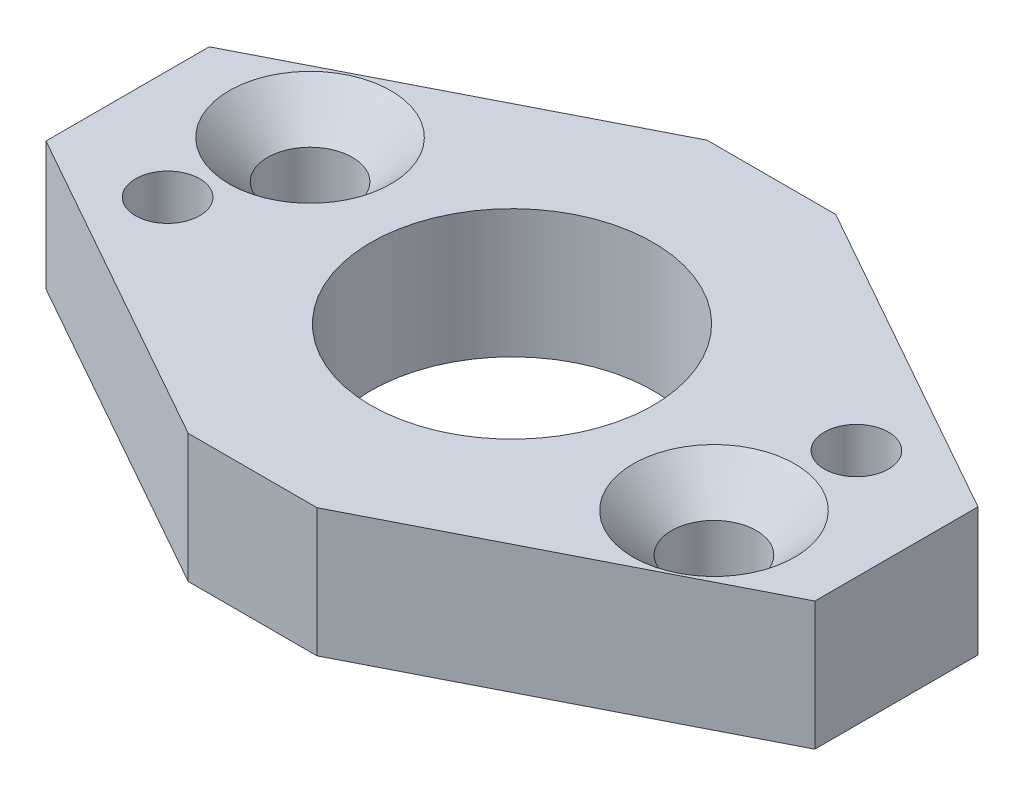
ISO-10303-21;
HEADER;
FILE_DESCRIPTION(('STEP AP214'),'2;1');
FILE_NAME('part.step','',(''),(''),'','','');
FILE_SCHEMA(('AUTOMOTIVE_DESIGN { 1 0 10303 214 1 1 1 1 }'));
ENDSEC;
DATA;
#1=APPLICATION_CONTEXT('core data for automotive mechanical design processes');
#2=APPLICATION_PROTOCOL_DEFINITION('international standard','automotive_design',2000,#1);
#3=PRODUCT_CONTEXT('',#1,'mechanical');
#4=PRODUCT('Part','Part','',(#3));
#5=PRODUCT_RELATED_PRODUCT_CATEGORY('part','',(#4));
#6=PRODUCT_DEFINITION_FORMATION('','',#4);
#7=PRODUCT_DEFINITION_CONTEXT('part definition',#1,'design');
#8=PRODUCT_DEFINITION('design','',#6,#7);
#9=PRODUCT_DEFINITION_SHAPE('','',#8);
#10=(LENGTH_UNIT() NAMED_UNIT(*) SI_UNIT(.MILLI.,.METRE.));
#11=(NAMED_UNIT(*) PLANE_ANGLE_UNIT() SI_UNIT($,.RADIAN.));
#12=(NAMED_UNIT(*) SI_UNIT($,.STERADIAN.) SOLID_ANGLE_UNIT());
#13=UNCERTAINTY_MEASURE_WITH_UNIT(LENGTH_MEASURE(1.E-05),#10,'distance_accuracy_value','');
#14=(GEOMETRIC_REPRESENTATION_CONTEXT(3) GLOBAL_UNCERTAINTY_ASSIGNED_CONTEXT((#13)) GLOBAL_UNIT_ASSIGNED_CONTEXT((#10,
#11,#12)) REPRESENTATION_CONTEXT('',''));
#15=CARTESIAN_POINT('',(0.,0.,0.));
#16=DIRECTION('',(0.,0.,1.));
#17=DIRECTION('',(1.,0.,0.));
#18=AXIS2_PLACEMENT_3D('',#15,#16,#17);
#19=CARTESIAN_POINT('',(-30.5,10.,-20.));
#20=DIRECTION('',(1.,0.,0.));
#21=DIRECTION('',(0.,0.,-1.));
#22=AXIS2_PLACEMENT_3D('',#19,#20,#21);
#23=PLANE('',#22);
#24=DIRECTION('',(0.,0.,1.));
#25=VECTOR('',#24,1.);
#26=CARTESIAN_POINT('',(-30.5,0.,-20.));
#27=LINE('',#26,#25);
#28=CARTESIAN_POINT('',(-30.5,0.,-6.90354936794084));
#29=VERTEX_POINT('',#28);
#30=CARTESIAN_POINT('',(-30.5,0.,5.81325296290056));
#31=VERTEX_POINT('',#30);
#32=EDGE_CURVE('E127',#29,#31,#27,.T.);
#33=ORIENTED_EDGE('',*,*,#32,.T.);
#34=DIRECTION('',(0.,1.,0.));
#35=VECTOR('',#34,1.);
#36=CARTESIAN_POINT('',(-30.5,0.,5.81325296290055));
#37=LINE('',#36,#35);
#38=CARTESIAN_POINT('',(-30.5,10.,5.81325296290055));
#39=VERTEX_POINT('',#38);
#40=EDGE_CURVE('E63',#31,#39,#37,.T.);
#41=ORIENTED_EDGE('',*,*,#40,.T.);
#42=DIRECTION('',(0.,0.,1.));
#43=VECTOR('',#42,1.);
#44=CARTESIAN_POINT('',(-30.5,10.,-20.));
#45=LINE('',#44,#43);
#46=CARTESIAN_POINT('',(-30.5,10.,-6.90354936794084));
#47=VERTEX_POINT('',#46);
#48=EDGE_CURVE('E126',#47,#39,#45,.T.);
#49=ORIENTED_EDGE('',*,*,#48,.F.);
#50=DIRECTION('',(0.,1.,0.));
#51=VECTOR('',#50,1.);
#52=CARTESIAN_POINT('',(-30.5,0.,-6.90354936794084));
#53=LINE('',#52,#51);
#54=EDGE_CURVE('E184',#29,#47,#53,.T.);
#55=ORIENTED_EDGE('',*,*,#54,.F.);
#56=EDGE_LOOP('',(#33,#41,#49,#55));
#57=FACE_BOUND('',#56,.T.);
#58=ADVANCED_FACE('F39',(#57),#23,.F.);
#59=CARTESIAN_POINT('',(-30.5,10.,20.));
#60=DIRECTION('',(0.,0.,-1.));
#61=DIRECTION('',(-1.,0.,0.));
#62=AXIS2_PLACEMENT_3D('',#59,#60,#61);
#63=PLANE('',#62);
#64=DIRECTION('',(1.,0.,0.));
#65=VECTOR('',#64,1.);
#66=CARTESIAN_POINT('',(-30.5,0.,20.));
#67=LINE('',#66,#65);
#68=CARTESIAN_POINT('',(-5.23017488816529,0.,20.));
#69=VERTEX_POINT('',#68);
#70=CARTESIAN_POINT('',(4.80253523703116,0.,20.));
#71=VERTEX_POINT('',#70);
#72=EDGE_CURVE('E124',#69,#71,#67,.T.);
#73=ORIENTED_EDGE('',*,*,#72,.T.);
#74=DIRECTION('',(0.,1.,0.));
#75=VECTOR('',#74,1.);
#76=CARTESIAN_POINT('',(4.80253523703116,0.,20.));
#77=LINE('',#76,#75);
#78=CARTESIAN_POINT('',(4.80253523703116,10.,20.));
#79=VERTEX_POINT('',#78);
#80=EDGE_CURVE('E55',#71,#79,#77,.T.);
#81=ORIENTED_EDGE('',*,*,#80,.T.);
#82=DIRECTION('',(1.,0.,0.));
#83=VECTOR('',#82,1.);
#84=CARTESIAN_POINT('',(-30.5,10.,20.));
#85=LINE('',#84,#83);
#86=CARTESIAN_POINT('',(-5.23017488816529,10.,20.));
#87=VERTEX_POINT('',#86);
#88=EDGE_CURVE('E134',#87,#79,#85,.T.);
#89=ORIENTED_EDGE('',*,*,#88,.F.);
#90=DIRECTION('',(0.,1.,0.));
#91=VECTOR('',#90,1.);
#92=CARTESIAN_POINT('',(-5.23017488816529,0.,20.));
#93=LINE('',#92,#91);
#94=EDGE_CURVE('E192',#69,#87,#93,.T.);
#95=ORIENTED_EDGE('',*,*,#94,.F.);
#96=EDGE_LOOP('',(#73,#81,#89,#95));
#97=FACE_BOUND('',#96,.T.);
#98=ADVANCED_FACE('F203',(#97),#63,.F.);
#99=CARTESIAN_POINT('',(30.5,10.,-20.));
#100=DIRECTION('',(-1.,0.,0.));
#101=DIRECTION('',(0.,0.,1.));
#102=AXIS2_PLACEMENT_3D('',#99,#100,#101);
#103=PLANE('',#102);
#104=DIRECTION('',(0.,0.,-1.));
#105=VECTOR('',#104,1.);
#106=CARTESIAN_POINT('',(30.5,10.,-20.));
#107=LINE('',#106,#105);
#108=CARTESIAN_POINT('',(30.5,10.,6.90354936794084));
#109=VERTEX_POINT('',#108);
#110=CARTESIAN_POINT('',(30.5,10.,-5.81325296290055));
#111=VERTEX_POINT('',#110);
#112=EDGE_CURVE('E47',#109,#111,#107,.T.);
#113=ORIENTED_EDGE('',*,*,#112,.F.);
#114=DIRECTION('',(0.,1.,0.));
#115=VECTOR('',#114,1.);
#116=CARTESIAN_POINT('',(30.5,0.,6.90354936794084));
#117=LINE('',#116,#115);
#118=CARTESIAN_POINT('',(30.5,0.,6.90354936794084));
#119=VERTEX_POINT('',#118);
#120=EDGE_CURVE('E105',#119,#109,#117,.T.);
#121=ORIENTED_EDGE('',*,*,#120,.F.);
#122=DIRECTION('',(0.,0.,-1.));
#123=VECTOR('',#122,1.);
#124=CARTESIAN_POINT('',(30.5,0.,-20.));
#125=LINE('',#124,#123);
#126=CARTESIAN_POINT('',(30.5,0.,-5.81325296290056));
#127=VERTEX_POINT('',#126);
#128=EDGE_CURVE('E117',#119,#127,#125,.T.);
#129=ORIENTED_EDGE('',*,*,#128,.T.);
#130=DIRECTION('',(0.,1.,0.));
#131=VECTOR('',#130,1.);
#132=CARTESIAN_POINT('',(30.5,0.,-5.81325296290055));
#133=LINE('',#132,#131);
#134=EDGE_CURVE('E177',#127,#111,#133,.T.);
#135=ORIENTED_EDGE('',*,*,#134,.T.);
#136=EDGE_LOOP('',(#113,#121,#129,#135));
#137=FACE_BOUND('',#136,.T.);
#138=ADVANCED_FACE('F115',(#137),#103,.F.);
#139=CARTESIAN_POINT('',(-30.5,10.,-20.));
#140=DIRECTION('',(0.,0.,1.));
#141=DIRECTION('',(1.,0.,0.));
#142=AXIS2_PLACEMENT_3D('',#139,#140,#141);
#143=PLANE('',#142);
#144=DIRECTION('',(-1.,0.,0.));
#145=VECTOR('',#144,1.);
#146=CARTESIAN_POINT('',(-30.5,0.,-20.));
#147=LINE('',#146,#145);
#148=CARTESIAN_POINT('',(5.23017488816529,0.,-20.));
#149=VERTEX_POINT('',#148);
#150=CARTESIAN_POINT('',(-4.80253523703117,0.,-20.));
#151=VERTEX_POINT('',#150);
#152=EDGE_CURVE('E42',#149,#151,#147,.T.);
#153=ORIENTED_EDGE('',*,*,#152,.T.);
#154=DIRECTION('',(0.,1.,0.));
#155=VECTOR('',#154,1.);
#156=CARTESIAN_POINT('',(-4.80253523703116,0.,-20.));
#157=LINE('',#156,#155);
#158=CARTESIAN_POINT('',(-4.80253523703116,10.,-20.));
#159=VERTEX_POINT('',#158);
#160=EDGE_CURVE('E174',#151,#159,#157,.T.);
#161=ORIENTED_EDGE('',*,*,#160,.T.);
#162=DIRECTION('',(-1.,0.,0.));
#163=VECTOR('',#162,1.);
#164=CARTESIAN_POINT('',(-30.5,10.,-20.));
#165=LINE('',#164,#163);
#166=CARTESIAN_POINT('',(5.23017488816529,10.,-20.));
#167=VERTEX_POINT('',#166);
#168=EDGE_CURVE('E11',#167,#159,#165,.T.);
#169=ORIENTED_EDGE('',*,*,#168,.F.);
#170=DIRECTION('',(0.,1.,0.));
#171=VECTOR('',#170,1.);
#172=CARTESIAN_POINT('',(5.23017488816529,0.,-20.));
#173=LINE('',#172,#171);
#174=EDGE_CURVE('E175',#149,#167,#173,.T.);
#175=ORIENTED_EDGE('',*,*,#174,.F.);
#176=EDGE_LOOP('',(#153,#161,#169,#175));
#177=FACE_BOUND('',#176,.T.);
#178=ADVANCED_FACE('F217',(#177),#143,.F.);
#179=CARTESIAN_POINT('',(0.,10.,0.));
#180=DIRECTION('',(0.,1.,0.));
#181=DIRECTION('',(0.,0.,1.));
#182=AXIS2_PLACEMENT_3D('',#179,#180,#181);
#183=PLANE('',#182);
#184=DIRECTION('',(-0.890965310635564,0.,0.454071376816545));
#185=VECTOR('',#184,1.);
#186=CARTESIAN_POINT('',(30.5,10.,6.90354936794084));
#187=LINE('',#186,#185);
#188=EDGE_CURVE('E111',#109,#79,#187,.T.);
#189=ORIENTED_EDGE('',*,*,#188,.F.);
#190=ORIENTED_EDGE('',*,*,#112,.T.);
#191=DIRECTION('',(0.871981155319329,0.,0.489539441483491));
#192=VECTOR('',#191,1.);
#193=CARTESIAN_POINT('',(30.5,10.,-5.81325296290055));
#194=LINE('',#193,#192);
#195=EDGE_CURVE('E180',#167,#111,#194,.T.);
#196=ORIENTED_EDGE('',*,*,#195,.F.);
#197=ORIENTED_EDGE('',*,*,#168,.T.);
#198=DIRECTION('',(0.890965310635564,0.,-0.454071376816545));
#199=VECTOR('',#198,1.);
#200=CARTESIAN_POINT('',(-30.5,10.,-6.90354936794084));
#201=LINE('',#200,#199);
#202=EDGE_CURVE('E179',#47,#159,#201,.T.);
#203=ORIENTED_EDGE('',*,*,#202,.F.);
#204=ORIENTED_EDGE('',*,*,#48,.T.);
#205=DIRECTION('',(-0.871981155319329,0.,-0.489539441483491));
#206=VECTOR('',#205,1.);
#207=CARTESIAN_POINT('',(-30.5,10.,5.81325296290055));
#208=LINE('',#207,#206);
#209=EDGE_CURVE('E196',#87,#39,#208,.T.);
#210=ORIENTED_EDGE('',*,*,#209,.F.);
#211=ORIENTED_EDGE('',*,*,#88,.T.);
#212=EDGE_LOOP('',(#189,#190,#196,#197,#203,#204,#210,#211));
#213=FACE_BOUND('',#212,.T.);
#214=CARTESIAN_POINT('',(20.4617713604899,10.,4.72397214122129));
#215=DIRECTION('',(0.,1.,0.));
#216=DIRECTION('',(0.,0.,1.));
#217=AXIS2_PLACEMENT_3D('',#214,#215,#216);
#218=CIRCLE('',#217,6.3);
#219=CARTESIAN_POINT('',(20.4617713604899,10.,11.0239721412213));
#220=VERTEX_POINT('',#219);
#221=EDGE_CURVE('E171',#220,#220,#218,.T.);
#222=ORIENTED_EDGE('',*,*,#221,.F.);
#223=EDGE_LOOP('',(#222));
#224=FACE_BOUND('',#223,.T.);
#225=CARTESIAN_POINT('',(-20.4617713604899,10.,-4.7239721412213));
#226=DIRECTION('',(0.,1.,0.));
#227=DIRECTION('',(0.,0.,1.));
#228=AXIS2_PLACEMENT_3D('',#225,#226,#227);
#229=CIRCLE('',#228,6.3);
#230=CARTESIAN_POINT('',(-20.4617713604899,10.,1.5760278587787));
#231=VERTEX_POINT('',#230);
#232=EDGE_CURVE('E162',#231,#231,#229,.T.);
#233=ORIENTED_EDGE('',*,*,#232,.F.);
#234=EDGE_LOOP('',(#233));
#235=FACE_BOUND('',#234,.T.);
#236=CARTESIAN_POINT('',(-21.9666601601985,10.,4.86989131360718));
#237=DIRECTION('',(0.,1.,0.));
#238=DIRECTION('',(0.,0.,1.));
#239=AXIS2_PLACEMENT_3D('',#236,#237,#238);
#240=CIRCLE('',#239,2.49999999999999);
#241=CARTESIAN_POINT('',(-21.9666601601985,10.,7.36989131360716));
#242=VERTEX_POINT('',#241);
#243=EDGE_CURVE('E153',#242,#242,#240,.T.);
#244=ORIENTED_EDGE('',*,*,#243,.F.);
#245=EDGE_LOOP('',(#244));
#246=FACE_BOUND('',#245,.T.);
#247=CARTESIAN_POINT('',(21.9666601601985,10.,-4.86989131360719));
#248=DIRECTION('',(0.,1.,0.));
#249=DIRECTION('',(0.,0.,1.));
#250=AXIS2_PLACEMENT_3D('',#247,#248,#249);
#251=CIRCLE('',#250,2.49999999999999);
#252=CARTESIAN_POINT('',(21.9666601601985,10.,-2.3698913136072));
#253=VERTEX_POINT('',#252);
#254=EDGE_CURVE('E147',#253,#253,#251,.T.);
#255=ORIENTED_EDGE('',*,*,#254,.F.);
#256=EDGE_LOOP('',(#255));
#257=FACE_BOUND('',#256,.T.);
#258=CARTESIAN_POINT('',(0.,10.,0.));
#259=DIRECTION('',(0.,1.,0.));
#260=DIRECTION('',(0.,0.,1.));
#261=AXIS2_PLACEMENT_3D('',#258,#259,#260);
#262=CIRCLE('',#261,11.);
#263=CARTESIAN_POINT('',(0.,10.,11.));
#264=VERTEX_POINT('',#263);
#265=EDGE_CURVE('E139',#264,#264,#262,.T.);
#266=ORIENTED_EDGE('',*,*,#265,.F.);
#267=EDGE_LOOP('',(#266));
#268=FACE_BOUND('',#267,.T.);
#269=ADVANCED_FACE('F206',(#213,#224,#235,#246,#257,#268),#183,.T.);
#270=CARTESIAN_POINT('',(0.,0.,0.));
#271=DIRECTION('',(0.,1.,0.));
#272=DIRECTION('',(0.,0.,1.));
#273=AXIS2_PLACEMENT_3D('',#270,#271,#272);
#274=PLANE('',#273);
#275=CARTESIAN_POINT('',(20.4617713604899,0.,4.72397214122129));
#276=DIRECTION('',(0.,1.,0.));
#277=DIRECTION('',(0.,0.,1.));
#278=AXIS2_PLACEMENT_3D('',#275,#276,#277);
#279=CIRCLE('',#278,3.3);
#280=CARTESIAN_POINT('',(20.4617713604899,0.,8.02397214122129));
#281=VERTEX_POINT('',#280);
#282=EDGE_CURVE('E165',#281,#281,#279,.T.);
#283=ORIENTED_EDGE('',*,*,#282,.T.);
#284=EDGE_LOOP('',(#283));
#285=FACE_BOUND('',#284,.T.);
#286=CARTESIAN_POINT('',(-20.4617713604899,0.,-4.7239721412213));
#287=DIRECTION('',(0.,1.,0.));
#288=DIRECTION('',(0.,0.,1.));
#289=AXIS2_PLACEMENT_3D('',#286,#287,#288);
#290=CIRCLE('',#289,3.3);
#291=CARTESIAN_POINT('',(-20.4617713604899,0.,-1.4239721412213));
#292=VERTEX_POINT('',#291);
#293=EDGE_CURVE('E156',#292,#292,#290,.T.);
#294=ORIENTED_EDGE('',*,*,#293,.T.);
#295=EDGE_LOOP('',(#294));
#296=FACE_BOUND('',#295,.T.);
#297=CARTESIAN_POINT('',(-21.9666601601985,0.,4.86989131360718));
#298=DIRECTION('',(0.,1.,0.));
#299=DIRECTION('',(0.,0.,1.));
#300=AXIS2_PLACEMENT_3D('',#297,#298,#299);
#301=CIRCLE('',#300,2.49999999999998);
#302=CARTESIAN_POINT('',(-21.9666601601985,0.,7.36989131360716));
#303=VERTEX_POINT('',#302);
#304=EDGE_CURVE('E150',#303,#303,#301,.T.);
#305=ORIENTED_EDGE('',*,*,#304,.T.);
#306=EDGE_LOOP('',(#305));
#307=FACE_BOUND('',#306,.T.);
#308=CARTESIAN_POINT('',(21.9666601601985,0.,-4.86989131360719));
#309=DIRECTION('',(0.,1.,0.));
#310=DIRECTION('',(0.,0.,1.));
#311=AXIS2_PLACEMENT_3D('',#308,#309,#310);
#312=CIRCLE('',#311,2.49999999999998);
#313=CARTESIAN_POINT('',(21.9666601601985,0.,-2.36989131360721));
#314=VERTEX_POINT('',#313);
#315=EDGE_CURVE('E142',#314,#314,#312,.T.);
#316=ORIENTED_EDGE('',*,*,#315,.T.);
#317=EDGE_LOOP('',(#316));
#318=FACE_BOUND('',#317,.T.);
#319=CARTESIAN_POINT('',(0.,0.,0.));
#320=DIRECTION('',(0.,1.,0.));
#321=DIRECTION('',(0.,0.,1.));
#322=AXIS2_PLACEMENT_3D('',#319,#320,#321);
#323=CIRCLE('',#322,11.);
#324=CARTESIAN_POINT('',(0.,0.,11.));
#325=VERTEX_POINT('',#324);
#326=EDGE_CURVE('E131',#325,#325,#323,.T.);
#327=ORIENTED_EDGE('',*,*,#326,.T.);
#328=EDGE_LOOP('',(#327));
#329=FACE_BOUND('',#328,.T.);
#330=ORIENTED_EDGE('',*,*,#128,.F.);
#331=DIRECTION('',(-0.890965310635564,0.,0.454071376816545));
#332=VECTOR('',#331,1.);
#333=CARTESIAN_POINT('',(30.5,0.,6.90354936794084));
#334=LINE('',#333,#332);
#335=EDGE_CURVE('E102',#119,#71,#334,.T.);
#336=ORIENTED_EDGE('',*,*,#335,.T.);
#337=ORIENTED_EDGE('',*,*,#72,.F.);
#338=DIRECTION('',(-0.871981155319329,0.,-0.489539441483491));
#339=VECTOR('',#338,1.);
#340=CARTESIAN_POINT('',(-30.5,0.,5.81325296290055));
#341=LINE('',#340,#339);
#342=EDGE_CURVE('E194',#69,#31,#341,.T.);
#343=ORIENTED_EDGE('',*,*,#342,.T.);
#344=ORIENTED_EDGE('',*,*,#32,.F.);
#345=DIRECTION('',(0.890965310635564,0.,-0.454071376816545));
#346=VECTOR('',#345,1.);
#347=CARTESIAN_POINT('',(-30.5,0.,-6.90354936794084));
#348=LINE('',#347,#346);
#349=EDGE_CURVE('E186',#29,#151,#348,.T.);
#350=ORIENTED_EDGE('',*,*,#349,.T.);
#351=ORIENTED_EDGE('',*,*,#152,.F.);
#352=DIRECTION('',(0.871981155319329,0.,0.489539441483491));
#353=VECTOR('',#352,1.);
#354=CARTESIAN_POINT('',(30.5,0.,-5.81325296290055));
#355=LINE('',#354,#353);
#356=EDGE_CURVE('E123',#149,#127,#355,.T.);
#357=ORIENTED_EDGE('',*,*,#356,.T.);
#358=EDGE_LOOP('',(#330,#336,#337,#343,#344,#350,#351,#357));
#359=FACE_BOUND('',#358,.T.);
#360=ADVANCED_FACE('F121',(#285,#296,#307,#318,#329,#359),#274,.F.);
#361=CARTESIAN_POINT('',(0.,0.,0.));
#362=DIRECTION('',(0.,1.,0.));
#363=DIRECTION('',(0.,0.,1.));
#364=AXIS2_PLACEMENT_3D('',#361,#362,#363);
#365=CYLINDRICAL_SURFACE('',#364,11.);
#366=ORIENTED_EDGE('',*,*,#326,.F.);
#367=EDGE_LOOP('',(#366));
#368=FACE_BOUND('',#367,.T.);
#369=ORIENTED_EDGE('',*,*,#265,.T.);
#370=EDGE_LOOP('',(#369));
#371=FACE_BOUND('',#370,.T.);
#372=ADVANCED_FACE('F245',(#368,#371),#365,.F.);
#373=CARTESIAN_POINT('',(21.9666601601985,10.,-4.86989131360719));
#374=DIRECTION('',(0.,1.,0.));
#375=DIRECTION('',(0.,0.,1.));
#376=AXIS2_PLACEMENT_3D('',#373,#374,#375);
#377=CYLINDRICAL_SURFACE('',#376,2.49999999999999);
#378=ORIENTED_EDGE('',*,*,#315,.F.);
#379=EDGE_LOOP('',(#378));
#380=FACE_BOUND('',#379,.T.);
#381=ORIENTED_EDGE('',*,*,#254,.T.);
#382=EDGE_LOOP('',(#381));
#383=FACE_BOUND('',#382,.T.);
#384=ADVANCED_FACE('F251',(#380,#383),#377,.F.);
#385=CARTESIAN_POINT('',(-21.9666601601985,10.,4.86989131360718));
#386=DIRECTION('',(0.,1.,0.));
#387=DIRECTION('',(0.,0.,1.));
#388=AXIS2_PLACEMENT_3D('',#385,#386,#387);
#389=CYLINDRICAL_SURFACE('',#388,2.49999999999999);
#390=ORIENTED_EDGE('',*,*,#304,.F.);
#391=EDGE_LOOP('',(#390));
#392=FACE_BOUND('',#391,.T.);
#393=ORIENTED_EDGE('',*,*,#243,.T.);
#394=EDGE_LOOP('',(#393));
#395=FACE_BOUND('',#394,.T.);
#396=ADVANCED_FACE('F255',(#392,#395),#389,.F.);
#397=CARTESIAN_POINT('',(-20.4617713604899,10.,-4.7239721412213));
#398=DIRECTION('',(0.,1.,0.));
#399=DIRECTION('',(0.,0.,1.));
#400=AXIS2_PLACEMENT_3D('',#397,#398,#399);
#401=CYLINDRICAL_SURFACE('',#400,3.3);
#402=ORIENTED_EDGE('',*,*,#293,.F.);
#403=EDGE_LOOP('',(#402));
#404=FACE_BOUND('',#403,.T.);
#405=CARTESIAN_POINT('',(-20.4617713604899,7.,-4.7239721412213));
#406=DIRECTION('',(0.,1.,0.));
#407=DIRECTION('',(0.,0.,1.));
#408=AXIS2_PLACEMENT_3D('',#405,#406,#407);
#409=CIRCLE('',#408,3.3);
#410=CARTESIAN_POINT('',(-20.4617713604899,7.,-1.4239721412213));
#411=VERTEX_POINT('',#410);
#412=EDGE_CURVE('E159',#411,#411,#409,.T.);
#413=ORIENTED_EDGE('',*,*,#412,.T.);
#414=EDGE_LOOP('',(#413));
#415=FACE_BOUND('',#414,.T.);
#416=ADVANCED_FACE('F259',(#404,#415),#401,.F.);
#417=CARTESIAN_POINT('',(-20.4617713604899,10.,-4.7239721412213));
#418=DIRECTION('',(0.,1.,0.));
#419=DIRECTION('',(0.,0.,1.));
#420=AXIS2_PLACEMENT_3D('',#417,#418,#419);
#421=CONICAL_SURFACE('',#420,6.3,0.785398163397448);
#422=ORIENTED_EDGE('',*,*,#412,.F.);
#423=EDGE_LOOP('',(#422));
#424=FACE_BOUND('',#423,.T.);
#425=ORIENTED_EDGE('',*,*,#232,.T.);
#426=EDGE_LOOP('',(#425));
#427=FACE_BOUND('',#426,.T.);
#428=ADVANCED_FACE('F263',(#424,#427),#421,.F.);
#429=CARTESIAN_POINT('',(20.4617713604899,10.,4.72397214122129));
#430=DIRECTION('',(0.,1.,0.));
#431=DIRECTION('',(0.,0.,1.));
#432=AXIS2_PLACEMENT_3D('',#429,#430,#431);
#433=CYLINDRICAL_SURFACE('',#432,3.3);
#434=ORIENTED_EDGE('',*,*,#282,.F.);
#435=EDGE_LOOP('',(#434));
#436=FACE_BOUND('',#435,.T.);
#437=CARTESIAN_POINT('',(20.4617713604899,7.,4.72397214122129));
#438=DIRECTION('',(0.,1.,0.));
#439=DIRECTION('',(0.,0.,1.));
#440=AXIS2_PLACEMENT_3D('',#437,#438,#439);
#441=CIRCLE('',#440,3.3);
#442=CARTESIAN_POINT('',(20.4617713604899,7.,8.02397214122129));
#443=VERTEX_POINT('',#442);
#444=EDGE_CURVE('E168',#443,#443,#441,.T.);
#445=ORIENTED_EDGE('',*,*,#444,.T.);
#446=EDGE_LOOP('',(#445));
#447=FACE_BOUND('',#446,.T.);
#448=ADVANCED_FACE('F267',(#436,#447),#433,.F.);
#449=CARTESIAN_POINT('',(20.4617713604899,10.,4.72397214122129));
#450=DIRECTION('',(0.,1.,0.));
#451=DIRECTION('',(0.,0.,1.));
#452=AXIS2_PLACEMENT_3D('',#449,#450,#451);
#453=CONICAL_SURFACE('',#452,6.3,0.785398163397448);
#454=ORIENTED_EDGE('',*,*,#444,.F.);
#455=EDGE_LOOP('',(#454));
#456=FACE_BOUND('',#455,.T.);
#457=ORIENTED_EDGE('',*,*,#221,.T.);
#458=EDGE_LOOP('',(#457));
#459=FACE_BOUND('',#458,.T.);
#460=ADVANCED_FACE('F230',(#456,#459),#453,.F.);
#461=CARTESIAN_POINT('',(30.5,0.,-5.81325296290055));
#462=DIRECTION('',(-0.489539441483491,0.,0.871981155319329));
#463=DIRECTION('',(0.871981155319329,0.,0.489539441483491));
#464=AXIS2_PLACEMENT_3D('',#461,#462,#463);
#465=PLANE('',#464);
#466=ORIENTED_EDGE('',*,*,#195,.T.);
#467=ORIENTED_EDGE('',*,*,#134,.F.);
#468=ORIENTED_EDGE('',*,*,#356,.F.);
#469=ORIENTED_EDGE('',*,*,#174,.T.);
#470=EDGE_LOOP('',(#466,#467,#468,#469));
#471=FACE_BOUND('',#470,.T.);
#472=ADVANCED_FACE('F221',(#471),#465,.F.);
#473=CARTESIAN_POINT('',(-30.5,0.,-6.90354936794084));
#474=DIRECTION('',(0.454071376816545,0.,0.890965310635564));
#475=DIRECTION('',(0.890965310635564,0.,-0.454071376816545));
#476=AXIS2_PLACEMENT_3D('',#473,#474,#475);
#477=PLANE('',#476);
#478=ORIENTED_EDGE('',*,*,#202,.T.);
#479=ORIENTED_EDGE('',*,*,#160,.F.);
#480=ORIENTED_EDGE('',*,*,#349,.F.);
#481=ORIENTED_EDGE('',*,*,#54,.T.);
#482=EDGE_LOOP('',(#478,#479,#480,#481));
#483=FACE_BOUND('',#482,.T.);
#484=ADVANCED_FACE('F222',(#483),#477,.F.);
#485=CARTESIAN_POINT('',(-30.5,0.,5.81325296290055));
#486=DIRECTION('',(0.489539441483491,0.,-0.871981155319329));
#487=DIRECTION('',(-0.871981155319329,0.,-0.489539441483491));
#488=AXIS2_PLACEMENT_3D('',#485,#486,#487);
#489=PLANE('',#488);
#490=ORIENTED_EDGE('',*,*,#209,.T.);
#491=ORIENTED_EDGE('',*,*,#40,.F.);
#492=ORIENTED_EDGE('',*,*,#342,.F.);
#493=ORIENTED_EDGE('',*,*,#94,.T.);
#494=EDGE_LOOP('',(#490,#491,#492,#493));
#495=FACE_BOUND('',#494,.T.);
#496=ADVANCED_FACE('F210',(#495),#489,.F.);
#497=CARTESIAN_POINT('',(30.5,0.,6.90354936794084));
#498=DIRECTION('',(-0.454071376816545,0.,-0.890965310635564));
#499=DIRECTION('',(-0.890965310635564,0.,0.454071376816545));
#500=AXIS2_PLACEMENT_3D('',#497,#498,#499);
#501=PLANE('',#500);
#502=ORIENTED_EDGE('',*,*,#188,.T.);
#503=ORIENTED_EDGE('',*,*,#80,.F.);
#504=ORIENTED_EDGE('',*,*,#335,.F.);
#505=ORIENTED_EDGE('',*,*,#120,.T.);
#506=EDGE_LOOP('',(#502,#503,#504,#505));
#507=FACE_BOUND('',#506,.T.);
#508=ADVANCED_FACE('F104',(#507),#501,.F.);
#509=CLOSED_SHELL('',(#58,#98,#138,#178,#269,#360,#372,#384,#396,#416,#428,#448,#460,#472,#484,
#496,#508));
#510=MANIFOLD_SOLID_BREP('B2',#509);
#511=ADVANCED_BREP_SHAPE_REPRESENTATION('',(#18,#510),#14);
#512=SHAPE_DEFINITION_REPRESENTATION(#9,#511);
ENDSEC;
END-ISO-10303-21;
